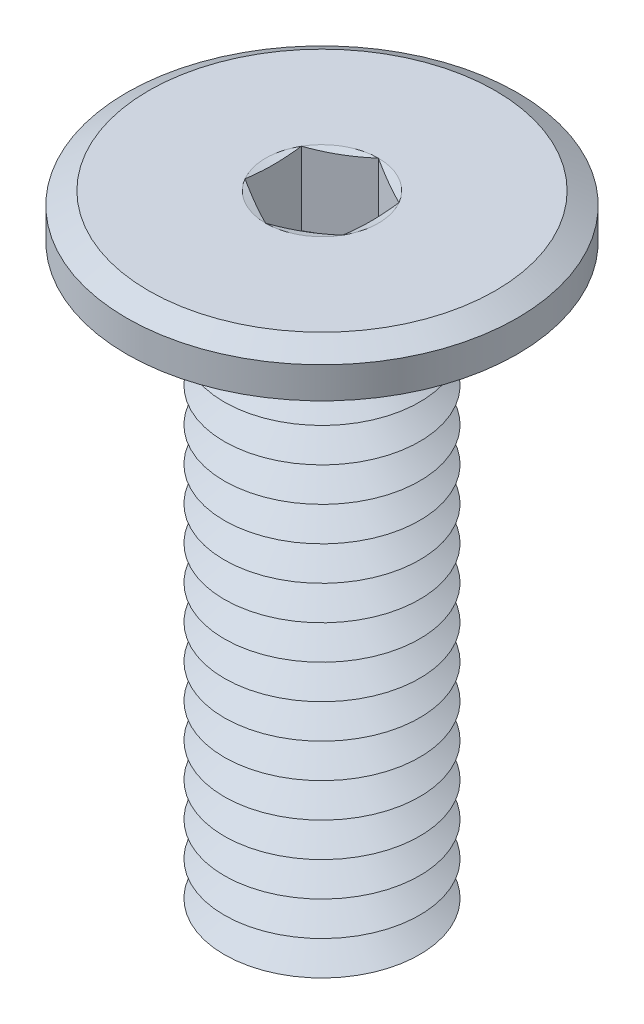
from build123d import *

# Parameters (mm, degrees)
SKETCH1_R           = 4
BOSS_EXTRUDE1_DEPTH = 0.9
SKETCH2_R           = 2
BOSS_EXTRUDE2_DEPTH = 12
LPATTERN1_COUNT     = 16
LPATTERN1_PITCH     = 0.7
FILLET1_R           = 0.2
CHAMFER2_SIZE       = 0.45
CHAMFER2_SIZE2      = 0.259807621
CUT_EXTRUDE1_DEPTH  = 1.5


with BuildPart() as part:
    # Sketch1 → Boss-Extrude1 (new body)
    with BuildSketch(Plane(origin=(0, 0, 0), x_dir=(1, 0, 0), z_dir=(0, 1, 0))):
        with Locations(Location((0, 0, 0), (0, 0, 270))):
            Circle(SKETCH1_R)
    extrude(amount=-BOSS_EXTRUDE1_DEPTH)

    # Sketch2 → Boss-Extrude2 (add)
    with BuildSketch(Plane.XZ.offset(0.9)):
        with Locations(Location((0, 0, 0), (0, 0, 270))):
            Circle(SKETCH2_R)
    extrude(amount=BOSS_EXTRUDE2_DEPTH)

    # Sketch5 → Cut-Revolve1 (revolve, cut)
    with BuildSketch(Plane(origin=(0, 0, 0), x_dir=(0, 0, -1), z_dir=(1, 0, 0))):
        Polygon((-2, -13.25), (-1.393782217, -12.9), (-2, -12.55), align=None)
    cut_revolve1 = revolve(axis=Axis((0, 0.990593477, 0), (0, -1, 0)), mode=Mode.SUBTRACT)

    # LPattern1: Cut-Revolve1 ×16
    with Locations(*[(0, i * LPATTERN1_PITCH, 0) for i in range(1, LPATTERN1_COUNT)]):
        add(cut_revolve1, mode=Mode.SUBTRACT)

    # Fillet1
    fillet1_edges = [part.edges().sort_by_distance(p)[0] for p in [
        (0, -0.9, 2),
    ]]
    fillet(fillet1_edges, radius=FILLET1_R)

    # Chamfer2
    chamfer2_edges = [part.edges().sort_by_distance(p)[0] for p in [
        (0, 0, -4),
    ]]
    chamfer2_side = [part.faces().sort_by_distance(p)[0] for p in [
        (0, 0, 0),
    ]]
    chamfer(chamfer2_edges, length=CHAMFER2_SIZE, length2=CHAMFER2_SIZE2, reference=chamfer2_side[0])

    # Sketch6 → Cut-Extrude1 (cut)
    with BuildSketch(Plane(origin=(0, 0, 0), x_dir=(1, 0, 0), z_dir=(0, 1, 0))):
        Polygon((0, 1.154700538), (-1, 0.577350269), (-1, -0.577350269), (0, -1.154700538), (1, -0.577350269), (1, 0.577350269), align=None)
    extrude(amount=-CUT_EXTRUDE1_DEPTH, mode=Mode.SUBTRACT)

    # Cut-Extrude2 cone 1 section (on through the dimple's axis) → Cut-Extrude2 (revolve, cut)
    with BuildSketch(Plane(origin=(0, -1.5, 0), x_dir=(0, 0, 1), z_dir=(1, 0, 0))):
        Polygon((0, 0), (1, 0), (0, 0.577350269), align=None)
    revolve(axis=Axis((0, -1.5, 0), (0, -1, 0)), mode=Mode.SUBTRACT)

    # Cut-Extrude3 cone 1 section (on through the dimple's axis) → Cut-Extrude3 (revolve, cut)
    with BuildSketch(Plane(origin=(0, 0, 0), x_dir=(0, 0, 1), z_dir=(1, 0, 0))):
        Polygon((0, 0), (1.154700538, 0), (0, 0.309401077), align=None)
    revolve(axis=Axis((0, 0, 0), (0, -1, 0)), mode=Mode.SUBTRACT)


solid = part.part
